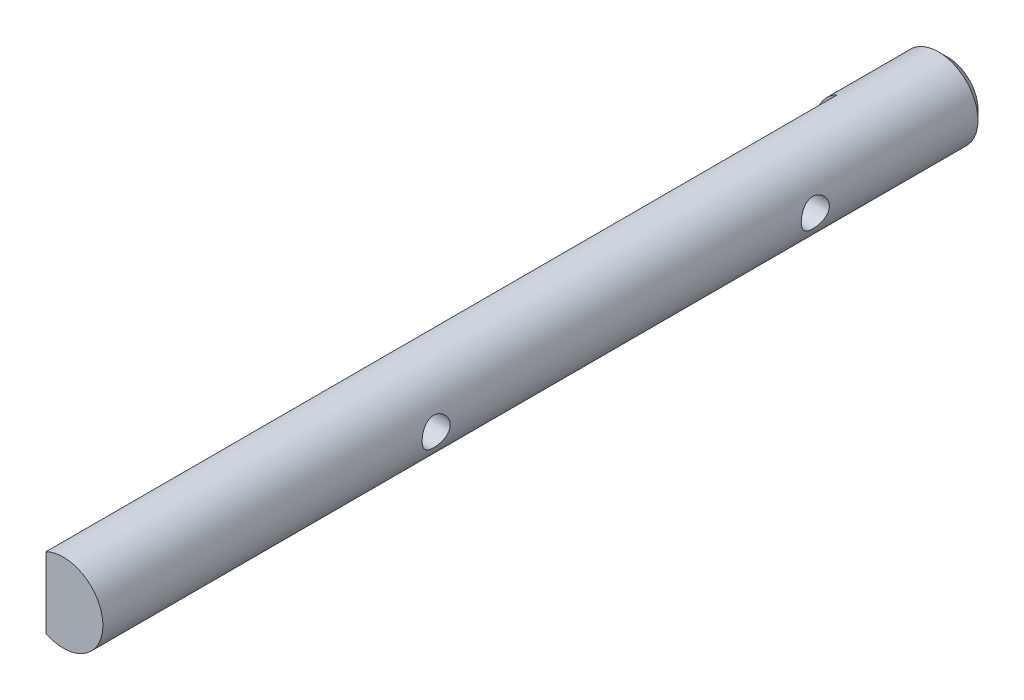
from build123d import *

# Parameters (mm, degrees)
SKETCH1_R               = 3.175
BOSS_EXTRUDE1_DEPTH     = 160.02
CHAMFER1_SIZE           = 0.762
CUT_EXTRUDE1_DEPTH      = 161.082983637
CUT_EXTRUDE1_DEPTH_BACK = 161.082983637
SKETCH2_R               = 1.1303
CUT_EXTRUDE2_START      = -3.175
SKETCH3_W               = 127
SKETCH3_H               = 6.35
CUT_EXTRUDE2_DEPTH      = 1.778
CUT_EXTRUDE3_START      = 88.9
SKETCH4_R               = 3.175
CUT_EXTRUDE3_DEPTH      = 88.9


with BuildPart() as part:
    # Sketch1 → Boss-Extrude1 (new body)
    with BuildSketch(Plane.XY):
        Circle(SKETCH1_R)
    extrude(amount=BOSS_EXTRUDE1_DEPTH)

    # Chamfer1
    chamfer1_edges = [part.edges().sort_by_distance(p)[0] for p in [
        (-3.175, 0, 0),
        (-3.175, 0, 160.02),
    ]]
    chamfer(chamfer1_edges, length=CHAMFER1_SIZE)

    # Sketch2 → Cut-Extrude1 (cut, two sides: drawn at the far end of the back side and taken through both)
    with BuildSketch(Plane(origin=(0, 0, 0), x_dir=(0, 0, -1), z_dir=(1, 0, 0)).offset(-CUT_EXTRUDE1_DEPTH_BACK)):
        with Locations((-13.843, 0)):
            Circle(SKETCH2_R)
        with Locations((-44.323, 0)):
            Circle(SKETCH2_R)
        with Locations((-97.663, 0)):
            Circle(SKETCH2_R)
        with Locations((-128.143, 0)):
            Circle(SKETCH2_R)
    extrude(amount=CUT_EXTRUDE1_DEPTH + CUT_EXTRUDE1_DEPTH_BACK, mode=Mode.SUBTRACT)

    # Sketch3 → Cut-Extrude2 (cut)
    with BuildSketch(Plane(origin=(0, 0, 0), x_dir=(0, 0, -1), z_dir=(1, 0, 0)).offset(CUT_EXTRUDE2_START)):
        with Locations((-70.993, 0)):
            Rectangle(SKETCH3_W, SKETCH3_H)
    extrude(amount=CUT_EXTRUDE2_DEPTH, mode=Mode.SUBTRACT)

    # Sketch4 → Cut-Extrude3 (cut)
    with BuildSketch(Plane(origin=(0, 0, 160.02), x_dir=(-1, 0, 0), z_dir=(0, 0, -1)).offset(CUT_EXTRUDE3_START)):
        with Locations(Location((0, 0, 0), (0, 0, 296.103881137))):
            Circle(SKETCH4_R)
    extrude(amount=-CUT_EXTRUDE3_DEPTH, mode=Mode.SUBTRACT)


solid = part.part
